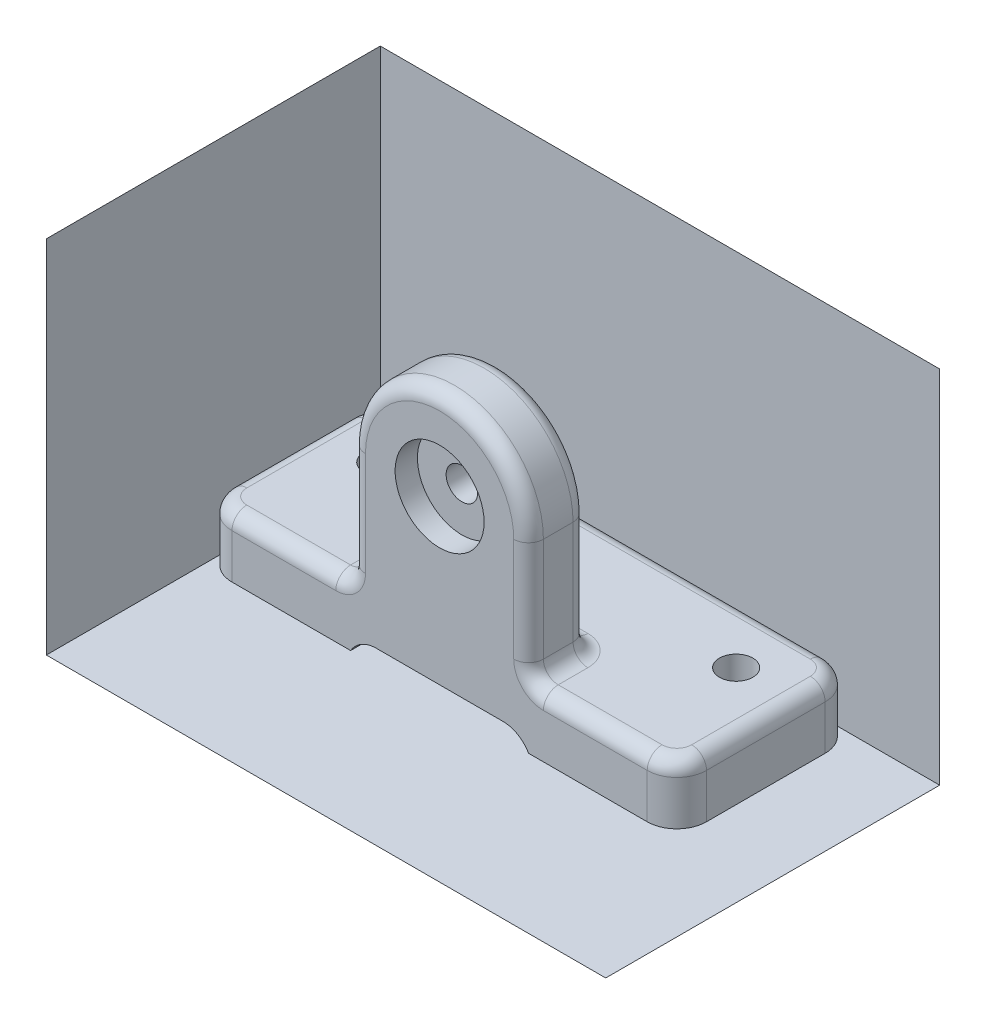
ISO-10303-21;
HEADER;
FILE_DESCRIPTION(('STEP AP214'),'2;1');
FILE_NAME('part.step','',(''),(''),'','','');
FILE_SCHEMA(('AUTOMOTIVE_DESIGN { 1 0 10303 214 1 1 1 1 }'));
ENDSEC;
DATA;
#1=APPLICATION_CONTEXT('core data for automotive mechanical design processes');
#2=APPLICATION_PROTOCOL_DEFINITION('international standard','automotive_design',2000,#1);
#3=PRODUCT_CONTEXT('',#1,'mechanical');
#4=PRODUCT('Part','Part','',(#3));
#5=PRODUCT_RELATED_PRODUCT_CATEGORY('part','',(#4));
#6=PRODUCT_DEFINITION_FORMATION('','',#4);
#7=PRODUCT_DEFINITION_CONTEXT('part definition',#1,'design');
#8=PRODUCT_DEFINITION('design','',#6,#7);
#9=PRODUCT_DEFINITION_SHAPE('','',#8);
#10=(LENGTH_UNIT() NAMED_UNIT(*) SI_UNIT(.MILLI.,.METRE.));
#11=(NAMED_UNIT(*) PLANE_ANGLE_UNIT() SI_UNIT($,.RADIAN.));
#12=(NAMED_UNIT(*) SI_UNIT($,.STERADIAN.) SOLID_ANGLE_UNIT());
#13=UNCERTAINTY_MEASURE_WITH_UNIT(LENGTH_MEASURE(1.E-05),#10,'distance_accuracy_value','');
#14=(GEOMETRIC_REPRESENTATION_CONTEXT(3) GLOBAL_UNCERTAINTY_ASSIGNED_CONTEXT((#13)) GLOBAL_UNIT_ASSIGNED_CONTEXT((#10,
#11,#12)) REPRESENTATION_CONTEXT('',''));
#15=CARTESIAN_POINT('',(0.,0.,0.));
#16=DIRECTION('',(0.,0.,1.));
#17=DIRECTION('',(1.,0.,0.));
#18=AXIS2_PLACEMENT_3D('',#15,#16,#17);
#19=CARTESIAN_POINT('',(0.,0.,33.4078891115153));
#20=DIRECTION('',(0.,1.,0.));
#21=DIRECTION('',(0.,0.,1.));
#22=AXIS2_PLACEMENT_3D('',#19,#20,#21);
#23=PLANE('',#22);
#24=DIRECTION('',(0.,0.,-1.));
#25=VECTOR('',#24,1.);
#26=CARTESIAN_POINT('',(0.,0.,-38.1));
#27=LINE('',#26,#25);
#28=CARTESIAN_POINT('',(0.,0.,33.4078891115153));
#29=VERTEX_POINT('',#28);
#30=CARTESIAN_POINT('',(0.,0.,-38.1));
#31=VERTEX_POINT('',#30);
#32=EDGE_CURVE('E50',#29,#31,#27,.T.);
#33=ORIENTED_EDGE('',*,*,#32,.T.);
#34=DIRECTION('',(1.,0.,0.));
#35=VECTOR('',#34,1.);
#36=CARTESIAN_POINT('',(0.,0.,-38.1));
#37=LINE('',#36,#35);
#38=CARTESIAN_POINT('',(119.774346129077,0.,-38.1));
#39=VERTEX_POINT('',#38);
#40=EDGE_CURVE('E61',#31,#39,#37,.T.);
#41=ORIENTED_EDGE('',*,*,#40,.T.);
#42=DIRECTION('',(0.,0.,1.));
#43=VECTOR('',#42,1.);
#44=CARTESIAN_POINT('',(119.774346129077,0.,-38.1));
#45=LINE('',#44,#43);
#46=CARTESIAN_POINT('',(119.774346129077,0.,33.4078891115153));
#47=VERTEX_POINT('',#46);
#48=EDGE_CURVE('E46',#39,#47,#45,.T.);
#49=ORIENTED_EDGE('',*,*,#48,.T.);
#50=DIRECTION('',(-1.,0.,0.));
#51=VECTOR('',#50,1.);
#52=CARTESIAN_POINT('',(0.,0.,33.4078891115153));
#53=LINE('',#52,#51);
#54=EDGE_CURVE('E12',#47,#29,#53,.T.);
#55=ORIENTED_EDGE('',*,*,#54,.T.);
#56=EDGE_LOOP('',(#33,#41,#49,#55));
#57=FACE_BOUND('',#56,.T.);
#58=ADVANCED_FACE('F41',(#57),#23,.F.);
#59=OPEN_SHELL('',(#58));
#60=SHELL_BASED_SURFACE_MODEL('B2',(#59));
#61=CARTESIAN_POINT('',(0.,77.180854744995,33.4078891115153));
#62=DIRECTION('',(1.,0.,0.));
#63=DIRECTION('',(0.,0.,-1.));
#64=AXIS2_PLACEMENT_3D('',#61,#62,#63);
#65=PLANE('',#64);
#66=DIRECTION('',(0.,1.,0.));
#67=VECTOR('',#66,1.);
#68=CARTESIAN_POINT('',(0.,77.180854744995,33.4078891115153));
#69=LINE('',#68,#67);
#70=CARTESIAN_POINT('',(0.,0.,33.4078891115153));
#71=VERTEX_POINT('',#70);
#72=CARTESIAN_POINT('',(0.,77.180854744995,33.4078891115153));
#73=VERTEX_POINT('',#72);
#74=EDGE_CURVE('E101',#71,#73,#69,.T.);
#75=ORIENTED_EDGE('',*,*,#74,.T.);
#76=DIRECTION('',(0.,0.,-1.));
#77=VECTOR('',#76,1.);
#78=CARTESIAN_POINT('',(0.,77.180854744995,33.4078891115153));
#79=LINE('',#78,#77);
#80=CARTESIAN_POINT('',(0.,77.180854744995,-38.1));
#81=VERTEX_POINT('',#80);
#82=EDGE_CURVE('E112',#73,#81,#79,.T.);
#83=ORIENTED_EDGE('',*,*,#82,.T.);
#84=DIRECTION('',(0.,-1.,0.));
#85=VECTOR('',#84,1.);
#86=CARTESIAN_POINT('',(0.,77.180854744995,-38.1));
#87=LINE('',#86,#85);
#88=CARTESIAN_POINT('',(0.,0.,-38.1));
#89=VERTEX_POINT('',#88);
#90=EDGE_CURVE('E97',#81,#89,#87,.T.);
#91=ORIENTED_EDGE('',*,*,#90,.T.);
#92=DIRECTION('',(0.,0.,1.));
#93=VECTOR('',#92,1.);
#94=CARTESIAN_POINT('',(0.,0.,33.4078891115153));
#95=LINE('',#94,#93);
#96=EDGE_CURVE('E39',#89,#71,#95,.T.);
#97=ORIENTED_EDGE('',*,*,#96,.T.);
#98=EDGE_LOOP('',(#75,#83,#91,#97));
#99=FACE_BOUND('',#98,.T.);
#100=ADVANCED_FACE('F92',(#99),#65,.F.);
#101=OPEN_SHELL('',(#100));
#102=SHELL_BASED_SURFACE_MODEL('B6',(#101));
#103=CARTESIAN_POINT('',(0.,0.,-38.1));
#104=DIRECTION('',(0.,0.,1.));
#105=DIRECTION('',(1.,0.,0.));
#106=AXIS2_PLACEMENT_3D('',#103,#104,#105);
#107=PLANE('',#106);
#108=DIRECTION('',(0.,1.,0.));
#109=VECTOR('',#108,1.);
#110=CARTESIAN_POINT('',(0.,77.180854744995,-38.1));
#111=LINE('',#110,#109);
#112=CARTESIAN_POINT('',(0.,0.,-38.1));
#113=VERTEX_POINT('',#112);
#114=CARTESIAN_POINT('',(0.,77.180854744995,-38.1));
#115=VERTEX_POINT('',#114);
#116=EDGE_CURVE('E151',#113,#115,#111,.T.);
#117=ORIENTED_EDGE('',*,*,#116,.T.);
#118=DIRECTION('',(1.,0.,0.));
#119=VECTOR('',#118,1.);
#120=CARTESIAN_POINT('',(0.,77.180854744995,-38.1));
#121=LINE('',#120,#119);
#122=CARTESIAN_POINT('',(119.774346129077,77.180854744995,-38.1));
#123=VERTEX_POINT('',#122);
#124=EDGE_CURVE('E162',#115,#123,#121,.T.);
#125=ORIENTED_EDGE('',*,*,#124,.T.);
#126=DIRECTION('',(0.,-1.,0.));
#127=VECTOR('',#126,1.);
#128=CARTESIAN_POINT('',(119.774346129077,77.180854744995,-38.1));
#129=LINE('',#128,#127);
#130=CARTESIAN_POINT('',(119.774346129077,0.,-38.1));
#131=VERTEX_POINT('',#130);
#132=EDGE_CURVE('E147',#123,#131,#129,.T.);
#133=ORIENTED_EDGE('',*,*,#132,.T.);
#134=DIRECTION('',(-1.,0.,0.));
#135=VECTOR('',#134,1.);
#136=CARTESIAN_POINT('',(0.,0.,-38.1));
#137=LINE('',#136,#135);
#138=EDGE_CURVE('E90',#131,#113,#137,.T.);
#139=ORIENTED_EDGE('',*,*,#138,.T.);
#140=EDGE_LOOP('',(#117,#125,#133,#139));
#141=FACE_BOUND('',#140,.T.);
#142=ADVANCED_FACE('F142',(#141),#107,.F.);
#143=OPEN_SHELL('',(#142));
#144=SHELL_BASED_SURFACE_MODEL('B33',(#143));
#145=CARTESIAN_POINT('',(0.,0.,-38.1));
#146=DIRECTION('',(0.,-1.,0.));
#147=DIRECTION('',(0.,0.,-1.));
#148=AXIS2_PLACEMENT_3D('',#145,#146,#147);
#149=PLANE('',#148);
#150=DIRECTION('',(0.,0.,-1.));
#151=VECTOR('',#150,1.);
#152=CARTESIAN_POINT('',(101.6,0.,0.));
#153=LINE('',#152,#151);
#154=CARTESIAN_POINT('',(101.6,0.,-6.35));
#155=VERTEX_POINT('',#154);
#156=CARTESIAN_POINT('',(101.6,0.,-31.75));
#157=VERTEX_POINT('',#156);
#158=EDGE_CURVE('E386',#155,#157,#153,.T.);
#159=ORIENTED_EDGE('',*,*,#158,.F.);
#160=CARTESIAN_POINT('',(95.25,0.,-6.35));
#161=DIRECTION('',(0.,-1.,0.));
#162=DIRECTION('',(0.,0.,-1.));
#163=AXIS2_PLACEMENT_3D('',#160,#161,#162);
#164=CIRCLE('',#163,6.35);
#165=CARTESIAN_POINT('',(95.25,0.,0.));
#166=VERTEX_POINT('',#165);
#167=EDGE_CURVE('E450',#155,#166,#164,.T.);
#168=ORIENTED_EDGE('',*,*,#167,.T.);
#169=DIRECTION('',(1.,0.,0.));
#170=VECTOR('',#169,1.);
#171=CARTESIAN_POINT('',(0.,0.,0.));
#172=LINE('',#171,#170);
#173=CARTESIAN_POINT('',(69.85,0.,-2.27373675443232E-10));
#174=VERTEX_POINT('',#173);
#175=EDGE_CURVE('E387',#174,#166,#172,.T.);
#176=ORIENTED_EDGE('',*,*,#175,.F.);
#177=DIRECTION('',(0.,0.,1.));
#178=VECTOR('',#177,1.);
#179=CARTESIAN_POINT('',(69.85,0.,-38.1));
#180=LINE('',#179,#178);
#181=CARTESIAN_POINT('',(69.85,0.,-38.1));
#182=VERTEX_POINT('',#181);
#183=EDGE_CURVE('E394',#182,#174,#180,.T.);
#184=ORIENTED_EDGE('',*,*,#183,.F.);
#185=DIRECTION('',(-1.,0.,0.));
#186=VECTOR('',#185,1.);
#187=CARTESIAN_POINT('',(0.,0.,-38.1));
#188=LINE('',#187,#186);
#189=CARTESIAN_POINT('',(95.25,0.,-38.1));
#190=VERTEX_POINT('',#189);
#191=EDGE_CURVE('E423',#190,#182,#188,.T.);
#192=ORIENTED_EDGE('',*,*,#191,.F.);
#193=CARTESIAN_POINT('',(95.25,0.,-31.75));
#194=DIRECTION('',(0.,-1.,0.));
#195=DIRECTION('',(0.,0.,-1.));
#196=AXIS2_PLACEMENT_3D('',#193,#194,#195);
#197=CIRCLE('',#196,6.35);
#198=EDGE_CURVE('E448',#190,#157,#197,.T.);
#199=ORIENTED_EDGE('',*,*,#198,.T.);
#200=EDGE_LOOP('',(#159,#168,#176,#184,#192,#199));
#201=FACE_BOUND('',#200,.T.);
#202=CARTESIAN_POINT('',(88.9,0.,-25.4));
#203=DIRECTION('',(0.,1.,0.));
#204=DIRECTION('',(0.,0.,1.));
#205=AXIS2_PLACEMENT_3D('',#202,#203,#204);
#206=CIRCLE('',#205,3.571875);
#207=CARTESIAN_POINT('',(88.9,0.,-21.828125));
#208=VERTEX_POINT('',#207);
#209=EDGE_CURVE('E668',#208,#208,#206,.T.);
#210=ORIENTED_EDGE('',*,*,#209,.T.);
#211=EDGE_LOOP('',(#210));
#212=FACE_BOUND('',#211,.T.);
#213=ADVANCED_FACE('F183',(#201,#212),#149,.T.);
#214=CARTESIAN_POINT('',(6.35,0.,0.));
#215=VERTEX_POINT('',#214);
#216=CARTESIAN_POINT('',(31.75,0.,-2.27373675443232E-10));
#217=VERTEX_POINT('',#216);
#218=EDGE_CURVE('E379',#215,#217,#172,.T.);
#219=ORIENTED_EDGE('',*,*,#218,.F.);
#220=CARTESIAN_POINT('',(6.35,0.,-6.35));
#221=DIRECTION('',(0.,-1.,0.));
#222=DIRECTION('',(0.,0.,-1.));
#223=AXIS2_PLACEMENT_3D('',#220,#221,#222);
#224=CIRCLE('',#223,6.35);
#225=CARTESIAN_POINT('',(0.,0.,-6.35));
#226=VERTEX_POINT('',#225);
#227=EDGE_CURVE('E436',#215,#226,#224,.T.);
#228=ORIENTED_EDGE('',*,*,#227,.T.);
#229=DIRECTION('',(0.,0.,1.));
#230=VECTOR('',#229,1.);
#231=CARTESIAN_POINT('',(0.,0.,0.));
#232=LINE('',#231,#230);
#233=CARTESIAN_POINT('',(0.,0.,-31.75));
#234=VERTEX_POINT('',#233);
#235=EDGE_CURVE('E416',#234,#226,#232,.T.);
#236=ORIENTED_EDGE('',*,*,#235,.F.);
#237=CARTESIAN_POINT('',(6.35,0.,-31.75));
#238=DIRECTION('',(0.,-1.,0.));
#239=DIRECTION('',(0.,0.,-1.));
#240=AXIS2_PLACEMENT_3D('',#237,#238,#239);
#241=CIRCLE('',#240,6.35);
#242=CARTESIAN_POINT('',(6.35,0.,-38.1));
#243=VERTEX_POINT('',#242);
#244=EDGE_CURVE('E434',#234,#243,#241,.T.);
#245=ORIENTED_EDGE('',*,*,#244,.T.);
#246=CARTESIAN_POINT('',(31.75,0.,-38.1));
#247=VERTEX_POINT('',#246);
#248=EDGE_CURVE('E393',#247,#243,#188,.T.);
#249=ORIENTED_EDGE('',*,*,#248,.F.);
#250=DIRECTION('',(0.,0.,1.));
#251=VECTOR('',#250,1.);
#252=CARTESIAN_POINT('',(31.75,0.,-38.1));
#253=LINE('',#252,#251);
#254=EDGE_CURVE('E370',#247,#217,#253,.T.);
#255=ORIENTED_EDGE('',*,*,#254,.T.);
#256=EDGE_LOOP('',(#219,#228,#236,#245,#249,#255));
#257=FACE_BOUND('',#256,.T.);
#258=CARTESIAN_POINT('',(12.7,0.,-25.4));
#259=DIRECTION('',(0.,1.,0.));
#260=DIRECTION('',(0.,0.,1.));
#261=AXIS2_PLACEMENT_3D('',#258,#259,#260);
#262=CIRCLE('',#261,3.571875);
#263=CARTESIAN_POINT('',(12.7,0.,-21.828125));
#264=VERTEX_POINT('',#263);
#265=EDGE_CURVE('E674',#264,#264,#262,.T.);
#266=ORIENTED_EDGE('',*,*,#265,.T.);
#267=EDGE_LOOP('',(#266));
#268=FACE_BOUND('',#267,.T.);
#269=ADVANCED_FACE('F390',(#257,#268),#149,.T.);
#270=CARTESIAN_POINT('',(0.,12.7,0.));
#271=DIRECTION('',(1.,0.,0.));
#272=DIRECTION('',(0.,0.,-1.));
#273=AXIS2_PLACEMENT_3D('',#270,#271,#272);
#274=PLANE('',#273);
#275=DIRECTION('',(0.,-1.,0.));
#276=VECTOR('',#275,1.);
#277=CARTESIAN_POINT('',(0.,12.7,-6.35));
#278=LINE('',#277,#276);
#279=CARTESIAN_POINT('',(0.,9.525,-6.35));
#280=VERTEX_POINT('',#279);
#281=EDGE_CURVE('E440',#226,#280,#278,.F.);
#282=ORIENTED_EDGE('',*,*,#281,.T.);
#283=DIRECTION('',(0.,0.,1.));
#284=VECTOR('',#283,1.);
#285=CARTESIAN_POINT('',(0.,9.525,0.));
#286=LINE('',#285,#284);
#287=CARTESIAN_POINT('',(0.,9.525,-31.75));
#288=VERTEX_POINT('',#287);
#289=EDGE_CURVE('E535',#280,#288,#286,.F.);
#290=ORIENTED_EDGE('',*,*,#289,.T.);
#291=DIRECTION('',(0.,-1.,0.));
#292=VECTOR('',#291,1.);
#293=CARTESIAN_POINT('',(0.,12.7,-31.75));
#294=LINE('',#293,#292);
#295=EDGE_CURVE('E438',#288,#234,#294,.T.);
#296=ORIENTED_EDGE('',*,*,#295,.T.);
#297=ORIENTED_EDGE('',*,*,#235,.T.);
#298=EDGE_LOOP('',(#282,#290,#296,#297));
#299=FACE_BOUND('',#298,.T.);
#300=ADVANCED_FACE('F185',(#299),#274,.F.);
#301=CARTESIAN_POINT('',(0.,12.7,0.));
#302=DIRECTION('',(0.,0.,-1.));
#303=DIRECTION('',(-1.,0.,0.));
#304=AXIS2_PLACEMENT_3D('',#301,#302,#303);
#305=PLANE('',#304);
#306=CARTESIAN_POINT('',(50.8,38.1,-1.13686837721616E-10));
#307=DIRECTION('',(0.,0.,1.));
#308=DIRECTION('',(1.,0.,0.));
#309=AXIS2_PLACEMENT_3D('',#306,#307,#308);
#310=CIRCLE('',#309,9.52499999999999);
#311=CARTESIAN_POINT('',(60.325,38.1,-1.13686837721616E-10));
#312=VERTEX_POINT('',#311);
#313=EDGE_CURVE('E409',#312,#312,#310,.T.);
#314=ORIENTED_EDGE('',*,*,#313,.F.);
#315=EDGE_LOOP('',(#314));
#316=FACE_BOUND('',#315,.T.);
#317=DIRECTION('',(0.,-1.,0.));
#318=VECTOR('',#317,1.);
#319=CARTESIAN_POINT('',(95.25,12.7,0.));
#320=LINE('',#319,#318);
#321=CARTESIAN_POINT('',(95.25,9.525,0.));
#322=VERTEX_POINT('',#321);
#323=EDGE_CURVE('E431',#166,#322,#320,.F.);
#324=ORIENTED_EDGE('',*,*,#323,.T.);
#325=DIRECTION('',(1.,0.,0.));
#326=VECTOR('',#325,1.);
#327=CARTESIAN_POINT('',(0.,9.525,0.));
#328=LINE('',#327,#326);
#329=CARTESIAN_POINT('',(73.025,9.525,0.));
#330=VERTEX_POINT('',#329);
#331=EDGE_CURVE('E533',#322,#330,#328,.F.);
#332=ORIENTED_EDGE('',*,*,#331,.T.);
#333=CARTESIAN_POINT('',(73.025,15.875,0.));
#334=DIRECTION('',(0.,0.,-1.));
#335=DIRECTION('',(-1.,0.,0.));
#336=AXIS2_PLACEMENT_3D('',#333,#334,#335);
#337=CIRCLE('',#336,6.35);
#338=CARTESIAN_POINT('',(66.675,15.875,0.));
#339=VERTEX_POINT('',#338);
#340=EDGE_CURVE('E530',#339,#330,#337,.F.);
#341=ORIENTED_EDGE('',*,*,#340,.F.);
#342=DIRECTION('',(0.,1.,0.));
#343=VECTOR('',#342,1.);
#344=CARTESIAN_POINT('',(66.675,38.1,0.));
#345=LINE('',#344,#343);
#346=CARTESIAN_POINT('',(66.675,38.1,0.));
#347=VERTEX_POINT('',#346);
#348=EDGE_CURVE('E528',#339,#347,#345,.T.);
#349=ORIENTED_EDGE('',*,*,#348,.T.);
#350=CARTESIAN_POINT('',(50.8,38.1,0.));
#351=DIRECTION('',(0.,0.,-1.));
#352=DIRECTION('',(-1.,0.,0.));
#353=AXIS2_PLACEMENT_3D('',#350,#351,#352);
#354=CIRCLE('',#353,15.875);
#355=CARTESIAN_POINT('',(34.925,38.1,0.));
#356=VERTEX_POINT('',#355);
#357=EDGE_CURVE('E526',#347,#356,#354,.F.);
#358=ORIENTED_EDGE('',*,*,#357,.T.);
#359=DIRECTION('',(0.,-1.,0.));
#360=VECTOR('',#359,1.);
#361=CARTESIAN_POINT('',(34.925,12.7,0.));
#362=LINE('',#361,#360);
#363=CARTESIAN_POINT('',(34.925,15.875,0.));
#364=VERTEX_POINT('',#363);
#365=EDGE_CURVE('E524',#356,#364,#362,.T.);
#366=ORIENTED_EDGE('',*,*,#365,.T.);
#367=CARTESIAN_POINT('',(28.575,15.875,0.));
#368=DIRECTION('',(0.,0.,-1.));
#369=DIRECTION('',(-1.,0.,0.));
#370=AXIS2_PLACEMENT_3D('',#367,#368,#369);
#371=CIRCLE('',#370,6.35);
#372=CARTESIAN_POINT('',(28.575,9.525,0.));
#373=VERTEX_POINT('',#372);
#374=EDGE_CURVE('E521',#373,#364,#371,.F.);
#375=ORIENTED_EDGE('',*,*,#374,.F.);
#376=DIRECTION('',(1.,0.,0.));
#377=VECTOR('',#376,1.);
#378=CARTESIAN_POINT('',(0.,9.525,0.));
#379=LINE('',#378,#377);
#380=CARTESIAN_POINT('',(6.35,9.525,0.));
#381=VERTEX_POINT('',#380);
#382=EDGE_CURVE('E519',#373,#381,#379,.F.);
#383=ORIENTED_EDGE('',*,*,#382,.T.);
#384=DIRECTION('',(0.,-1.,0.));
#385=VECTOR('',#384,1.);
#386=CARTESIAN_POINT('',(6.35,12.7,0.));
#387=LINE('',#386,#385);
#388=EDGE_CURVE('E383',#381,#215,#387,.T.);
#389=ORIENTED_EDGE('',*,*,#388,.T.);
#390=ORIENTED_EDGE('',*,*,#218,.T.);
#391=CARTESIAN_POINT('',(37.2492613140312,-3.17500000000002,0.));
#392=DIRECTION('',(0.,0.,-1.));
#393=DIRECTION('',(-1.,0.,0.));
#394=AXIS2_PLACEMENT_3D('',#391,#392,#393);
#395=CIRCLE('',#394,6.35);
#396=CARTESIAN_POINT('',(37.2492613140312,3.17499999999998,-2.27373675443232E-10));
#397=VERTEX_POINT('',#396);
#398=EDGE_CURVE('E365',#217,#397,#395,.T.);
#399=ORIENTED_EDGE('',*,*,#398,.T.);
#400=DIRECTION('',(-1.,0.,0.));
#401=VECTOR('',#400,1.);
#402=CARTESIAN_POINT('',(31.75,3.17499999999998,-2.27373675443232E-10));
#403=LINE('',#402,#401);
#404=CARTESIAN_POINT('',(64.3507386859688,3.17499999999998,-2.27373675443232E-10));
#405=VERTEX_POINT('',#404);
#406=EDGE_CURVE('E401',#405,#397,#403,.T.);
#407=ORIENTED_EDGE('',*,*,#406,.F.);
#408=CARTESIAN_POINT('',(64.3507386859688,-3.17500000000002,0.));
#409=DIRECTION('',(0.,0.,-1.));
#410=DIRECTION('',(-1.,0.,0.));
#411=AXIS2_PLACEMENT_3D('',#408,#409,#410);
#412=CIRCLE('',#411,6.35);
#413=EDGE_CURVE('E457',#405,#174,#412,.T.);
#414=ORIENTED_EDGE('',*,*,#413,.T.);
#415=ORIENTED_EDGE('',*,*,#175,.T.);
#416=EDGE_LOOP('',(#324,#332,#341,#349,#358,#366,#375,#383,#389,#390,#399,#407,#414,#415));
#417=FACE_BOUND('',#416,.T.);
#418=ADVANCED_FACE('F381',(#316,#417),#305,.F.);
#419=CARTESIAN_POINT('',(101.6,12.7,0.));
#420=DIRECTION('',(-1.,0.,0.));
#421=DIRECTION('',(0.,0.,1.));
#422=AXIS2_PLACEMENT_3D('',#419,#420,#421);
#423=PLANE('',#422);
#424=DIRECTION('',(0.,-1.,0.));
#425=VECTOR('',#424,1.);
#426=CARTESIAN_POINT('',(101.6,12.7,-31.75));
#427=LINE('',#426,#425);
#428=CARTESIAN_POINT('',(101.6,9.525,-31.75));
#429=VERTEX_POINT('',#428);
#430=EDGE_CURVE('E443',#157,#429,#427,.F.);
#431=ORIENTED_EDGE('',*,*,#430,.T.);
#432=DIRECTION('',(0.,0.,-1.));
#433=VECTOR('',#432,1.);
#434=CARTESIAN_POINT('',(101.6,9.525,0.));
#435=LINE('',#434,#433);
#436=CARTESIAN_POINT('',(101.6,9.525,-6.35));
#437=VERTEX_POINT('',#436);
#438=EDGE_CURVE('E504',#429,#437,#435,.F.);
#439=ORIENTED_EDGE('',*,*,#438,.T.);
#440=DIRECTION('',(0.,-1.,0.));
#441=VECTOR('',#440,1.);
#442=CARTESIAN_POINT('',(101.6,12.7,-6.35));
#443=LINE('',#442,#441);
#444=EDGE_CURVE('E446',#437,#155,#443,.T.);
#445=ORIENTED_EDGE('',*,*,#444,.T.);
#446=ORIENTED_EDGE('',*,*,#158,.T.);
#447=EDGE_LOOP('',(#431,#439,#445,#446));
#448=FACE_BOUND('',#447,.T.);
#449=ADVANCED_FACE('F696',(#448),#423,.F.);
#450=CARTESIAN_POINT('',(0.,12.7,-38.1));
#451=DIRECTION('',(0.,0.,1.));
#452=DIRECTION('',(1.,0.,0.));
#453=AXIS2_PLACEMENT_3D('',#450,#451,#452);
#454=PLANE('',#453);
#455=DIRECTION('',(0.,-1.,0.));
#456=VECTOR('',#455,1.);
#457=CARTESIAN_POINT('',(6.35,12.7,-38.1));
#458=LINE('',#457,#456);
#459=CARTESIAN_POINT('',(6.35,9.525,-38.1));
#460=VERTEX_POINT('',#459);
#461=EDGE_CURVE('E452',#243,#460,#458,.F.);
#462=ORIENTED_EDGE('',*,*,#461,.T.);
#463=DIRECTION('',(-1.,0.,0.));
#464=VECTOR('',#463,1.);
#465=CARTESIAN_POINT('',(0.,9.525,-38.1));
#466=LINE('',#465,#464);
#467=CARTESIAN_POINT('',(95.25,9.525,-38.1));
#468=VERTEX_POINT('',#467);
#469=EDGE_CURVE('E495',#460,#468,#466,.F.);
#470=ORIENTED_EDGE('',*,*,#469,.T.);
#471=DIRECTION('',(0.,-1.,0.));
#472=VECTOR('',#471,1.);
#473=CARTESIAN_POINT('',(95.25,12.7,-38.1));
#474=LINE('',#473,#472);
#475=EDGE_CURVE('E455',#468,#190,#474,.T.);
#476=ORIENTED_EDGE('',*,*,#475,.T.);
#477=ORIENTED_EDGE('',*,*,#191,.T.);
#478=CARTESIAN_POINT('',(64.3507386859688,-3.17500000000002,-38.1));
#479=DIRECTION('',(0.,0.,1.));
#480=DIRECTION('',(1.,0.,0.));
#481=AXIS2_PLACEMENT_3D('',#478,#479,#480);
#482=CIRCLE('',#481,6.35);
#483=CARTESIAN_POINT('',(64.3507386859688,3.17499999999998,-38.1));
#484=VERTEX_POINT('',#483);
#485=EDGE_CURVE('E376',#182,#484,#482,.T.);
#486=ORIENTED_EDGE('',*,*,#485,.T.);
#487=DIRECTION('',(-1.,0.,0.));
#488=VECTOR('',#487,1.);
#489=CARTESIAN_POINT('',(31.75,3.17499999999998,-38.1));
#490=LINE('',#489,#488);
#491=CARTESIAN_POINT('',(37.2492613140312,3.17499999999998,-38.1));
#492=VERTEX_POINT('',#491);
#493=EDGE_CURVE('E395',#484,#492,#490,.T.);
#494=ORIENTED_EDGE('',*,*,#493,.T.);
#495=CARTESIAN_POINT('',(37.2492613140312,-3.17500000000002,-38.1));
#496=DIRECTION('',(0.,0.,1.));
#497=DIRECTION('',(1.,0.,0.));
#498=AXIS2_PLACEMENT_3D('',#495,#496,#497);
#499=CIRCLE('',#498,6.35);
#500=EDGE_CURVE('E375',#492,#247,#499,.T.);
#501=ORIENTED_EDGE('',*,*,#500,.T.);
#502=ORIENTED_EDGE('',*,*,#248,.T.);
#503=EDGE_LOOP('',(#462,#470,#476,#477,#486,#494,#501,#502));
#504=FACE_BOUND('',#503,.T.);
#505=ADVANCED_FACE('F583',(#504),#454,.F.);
#506=CARTESIAN_POINT('',(0.,12.7,-38.1));
#507=DIRECTION('',(0.,-1.,0.));
#508=DIRECTION('',(0.,0.,-1.));
#509=AXIS2_PLACEMENT_3D('',#506,#507,#508);
#510=PLANE('',#509);
#511=CARTESIAN_POINT('',(66.675,12.7,-9.525));
#512=DIRECTION('',(0.,-1.,0.));
#513=DIRECTION('',(0.,0.,-1.));
#514=AXIS2_PLACEMENT_3D('',#511,#512,#513);
#515=CIRCLE('',#514,6.35);
#516=CARTESIAN_POINT('',(73.025,12.7,-9.525));
#517=VERTEX_POINT('',#516);
#518=CARTESIAN_POINT('',(66.675,12.7,-15.875));
#519=VERTEX_POINT('',#518);
#520=EDGE_CURVE('E487',#517,#519,#515,.F.);
#521=ORIENTED_EDGE('',*,*,#520,.F.);
#522=DIRECTION('',(0.,0.,1.));
#523=VECTOR('',#522,1.);
#524=CARTESIAN_POINT('',(73.025,12.7,-38.1));
#525=LINE('',#524,#523);
#526=CARTESIAN_POINT('',(73.025,12.7,-3.175));
#527=VERTEX_POINT('',#526);
#528=EDGE_CURVE('E490',#517,#527,#525,.T.);
#529=ORIENTED_EDGE('',*,*,#528,.T.);
#530=DIRECTION('',(1.,0.,0.));
#531=VECTOR('',#530,1.);
#532=CARTESIAN_POINT('',(0.,12.7,-3.175));
#533=LINE('',#532,#531);
#534=CARTESIAN_POINT('',(95.25,12.7,-3.175));
#535=VERTEX_POINT('',#534);
#536=EDGE_CURVE('E485',#527,#535,#533,.T.);
#537=ORIENTED_EDGE('',*,*,#536,.T.);
#538=CARTESIAN_POINT('',(95.25,12.7,-6.35));
#539=DIRECTION('',(0.,-1.,0.));
#540=DIRECTION('',(0.,0.,-1.));
#541=AXIS2_PLACEMENT_3D('',#538,#539,#540);
#542=CIRCLE('',#541,3.175);
#543=CARTESIAN_POINT('',(98.425,12.7,-6.35));
#544=VERTEX_POINT('',#543);
#545=EDGE_CURVE('E483',#535,#544,#542,.F.);
#546=ORIENTED_EDGE('',*,*,#545,.T.);
#547=DIRECTION('',(0.,0.,-1.));
#548=VECTOR('',#547,1.);
#549=CARTESIAN_POINT('',(98.425,12.7,-38.1));
#550=LINE('',#549,#548);
#551=CARTESIAN_POINT('',(98.425,12.7,-31.75));
#552=VERTEX_POINT('',#551);
#553=EDGE_CURVE('E476',#544,#552,#550,.T.);
#554=ORIENTED_EDGE('',*,*,#553,.T.);
#555=CARTESIAN_POINT('',(95.25,12.7,-31.75));
#556=DIRECTION('',(0.,-1.,0.));
#557=DIRECTION('',(0.,0.,-1.));
#558=AXIS2_PLACEMENT_3D('',#555,#556,#557);
#559=CIRCLE('',#558,3.175);
#560=CARTESIAN_POINT('',(95.25,12.7,-34.925));
#561=VERTEX_POINT('',#560);
#562=EDGE_CURVE('E473',#552,#561,#559,.F.);
#563=ORIENTED_EDGE('',*,*,#562,.T.);
#564=DIRECTION('',(-1.,0.,0.));
#565=VECTOR('',#564,1.);
#566=CARTESIAN_POINT('',(0.,12.7,-34.925));
#567=LINE('',#566,#565);
#568=CARTESIAN_POINT('',(6.35,12.7,-34.925));
#569=VERTEX_POINT('',#568);
#570=EDGE_CURVE('E471',#561,#569,#567,.T.);
#571=ORIENTED_EDGE('',*,*,#570,.T.);
#572=CARTESIAN_POINT('',(6.35,12.7,-31.75));
#573=DIRECTION('',(0.,-1.,0.));
#574=DIRECTION('',(0.,0.,-1.));
#575=AXIS2_PLACEMENT_3D('',#572,#573,#574);
#576=CIRCLE('',#575,3.175);
#577=CARTESIAN_POINT('',(3.175,12.7,-31.75));
#578=VERTEX_POINT('',#577);
#579=EDGE_CURVE('E467',#569,#578,#576,.F.);
#580=ORIENTED_EDGE('',*,*,#579,.T.);
#581=DIRECTION('',(0.,0.,1.));
#582=VECTOR('',#581,1.);
#583=CARTESIAN_POINT('',(3.175,12.7,-38.1));
#584=LINE('',#583,#582);
#585=CARTESIAN_POINT('',(3.175,12.7,-6.35));
#586=VERTEX_POINT('',#585);
#587=EDGE_CURVE('E465',#578,#586,#584,.T.);
#588=ORIENTED_EDGE('',*,*,#587,.T.);
#589=CARTESIAN_POINT('',(6.35,12.7,-6.35));
#590=DIRECTION('',(0.,-1.,0.));
#591=DIRECTION('',(0.,0.,-1.));
#592=AXIS2_PLACEMENT_3D('',#589,#590,#591);
#593=CIRCLE('',#592,3.175);
#594=CARTESIAN_POINT('',(6.35,12.7,-3.175));
#595=VERTEX_POINT('',#594);
#596=EDGE_CURVE('E463',#586,#595,#593,.F.);
#597=ORIENTED_EDGE('',*,*,#596,.T.);
#598=DIRECTION('',(1.,0.,0.));
#599=VECTOR('',#598,1.);
#600=CARTESIAN_POINT('',(0.,12.7,-3.175));
#601=LINE('',#600,#599);
#602=CARTESIAN_POINT('',(28.575,12.7,-3.175));
#603=VERTEX_POINT('',#602);
#604=EDGE_CURVE('E461',#595,#603,#601,.T.);
#605=ORIENTED_EDGE('',*,*,#604,.T.);
#606=DIRECTION('',(0.,0.,-1.));
#607=VECTOR('',#606,1.);
#608=CARTESIAN_POINT('',(28.575,12.7,-38.1));
#609=LINE('',#608,#607);
#610=CARTESIAN_POINT('',(28.575,12.7,-9.525));
#611=VERTEX_POINT('',#610);
#612=EDGE_CURVE('E469',#603,#611,#609,.T.);
#613=ORIENTED_EDGE('',*,*,#612,.T.);
#614=CARTESIAN_POINT('',(34.925,12.7,-9.525));
#615=DIRECTION('',(0.,-1.,0.));
#616=DIRECTION('',(0.,0.,-1.));
#617=AXIS2_PLACEMENT_3D('',#614,#615,#616);
#618=CIRCLE('',#617,6.35);
#619=CARTESIAN_POINT('',(34.925,12.7,-15.875));
#620=VERTEX_POINT('',#619);
#621=EDGE_CURVE('E478',#620,#611,#618,.F.);
#622=ORIENTED_EDGE('',*,*,#621,.F.);
#623=DIRECTION('',(1.,0.,0.));
#624=VECTOR('',#623,1.);
#625=CARTESIAN_POINT('',(0.,12.7,-15.875));
#626=LINE('',#625,#624);
#627=EDGE_CURVE('E481',#620,#519,#626,.T.);
#628=ORIENTED_EDGE('',*,*,#627,.T.);
#629=EDGE_LOOP('',(#521,#529,#537,#546,#554,#563,#571,#580,#588,#597,#605,#613,#622,#628));
#630=FACE_BOUND('',#629,.T.);
#631=CARTESIAN_POINT('',(88.9,12.6999999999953,-25.4));
#632=DIRECTION('',(0.,1.,0.));
#633=DIRECTION('',(0.,0.,1.));
#634=AXIS2_PLACEMENT_3D('',#631,#632,#633);
#635=CIRCLE('',#634,3.57187499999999);
#636=CARTESIAN_POINT('',(88.9,12.6999999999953,-21.828125));
#637=VERTEX_POINT('',#636);
#638=EDGE_CURVE('E671',#637,#637,#635,.T.);
#639=ORIENTED_EDGE('',*,*,#638,.F.);
#640=EDGE_LOOP('',(#639));
#641=FACE_BOUND('',#640,.T.);
#642=CARTESIAN_POINT('',(12.7,12.6999999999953,-25.4));
#643=DIRECTION('',(0.,1.,0.));
#644=DIRECTION('',(0.,0.,1.));
#645=AXIS2_PLACEMENT_3D('',#642,#643,#644);
#646=CIRCLE('',#645,3.57187499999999);
#647=CARTESIAN_POINT('',(12.7,12.6999999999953,-21.828125));
#648=VERTEX_POINT('',#647);
#649=EDGE_CURVE('E677',#648,#648,#646,.T.);
#650=ORIENTED_EDGE('',*,*,#649,.F.);
#651=EDGE_LOOP('',(#650));
#652=FACE_BOUND('',#651,.T.);
#653=ADVANCED_FACE('F684',(#630,#641,#652),#510,.F.);
#654=CARTESIAN_POINT('',(31.75,0.,-12.7));
#655=DIRECTION('',(-1.,0.,0.));
#656=DIRECTION('',(0.,0.,1.));
#657=AXIS2_PLACEMENT_3D('',#654,#655,#656);
#658=PLANE('',#657);
#659=DIRECTION('',(0.,0.,1.));
#660=VECTOR('',#659,1.);
#661=CARTESIAN_POINT('',(31.75,38.1,-12.7));
#662=LINE('',#661,#660);
#663=CARTESIAN_POINT('',(31.75,38.1,-9.525));
#664=VERTEX_POINT('',#663);
#665=CARTESIAN_POINT('',(31.75,38.1,-3.175));
#666=VERTEX_POINT('',#665);
#667=EDGE_CURVE('E413',#664,#666,#662,.T.);
#668=ORIENTED_EDGE('',*,*,#667,.F.);
#669=DIRECTION('',(0.,-1.,0.));
#670=VECTOR('',#669,1.);
#671=CARTESIAN_POINT('',(31.75,0.,-9.525));
#672=LINE('',#671,#670);
#673=CARTESIAN_POINT('',(31.75,15.875,-9.525));
#674=VERTEX_POINT('',#673);
#675=EDGE_CURVE('E502',#664,#674,#672,.T.);
#676=ORIENTED_EDGE('',*,*,#675,.T.);
#677=DIRECTION('',(0.,0.,-1.));
#678=VECTOR('',#677,1.);
#679=CARTESIAN_POINT('',(31.75,15.875,-12.7));
#680=LINE('',#679,#678);
#681=CARTESIAN_POINT('',(31.75,15.875,-3.175));
#682=VERTEX_POINT('',#681);
#683=EDGE_CURVE('E499',#674,#682,#680,.F.);
#684=ORIENTED_EDGE('',*,*,#683,.T.);
#685=DIRECTION('',(0.,-1.,0.));
#686=VECTOR('',#685,1.);
#687=CARTESIAN_POINT('',(31.75,38.1,-3.175));
#688=LINE('',#687,#686);
#689=EDGE_CURVE('E497',#682,#666,#688,.F.);
#690=ORIENTED_EDGE('',*,*,#689,.T.);
#691=EDGE_LOOP('',(#668,#676,#684,#690));
#692=FACE_BOUND('',#691,.T.);
#693=ADVANCED_FACE('F686',(#692),#658,.T.);
#694=CARTESIAN_POINT('',(69.85,38.1,-12.7));
#695=DIRECTION('',(1.,0.,0.));
#696=DIRECTION('',(0.,0.,-1.));
#697=AXIS2_PLACEMENT_3D('',#694,#695,#696);
#698=PLANE('',#697);
#699=DIRECTION('',(0.,0.,1.));
#700=VECTOR('',#699,1.);
#701=CARTESIAN_POINT('',(69.85,15.875,-12.7));
#702=LINE('',#701,#700);
#703=CARTESIAN_POINT('',(69.85,15.875,-3.175));
#704=VERTEX_POINT('',#703);
#705=CARTESIAN_POINT('',(69.85,15.875,-9.525));
#706=VERTEX_POINT('',#705);
#707=EDGE_CURVE('E191',#704,#706,#702,.F.);
#708=ORIENTED_EDGE('',*,*,#707,.T.);
#709=DIRECTION('',(0.,1.,0.));
#710=VECTOR('',#709,1.);
#711=CARTESIAN_POINT('',(69.85,38.1,-9.525));
#712=LINE('',#711,#710);
#713=CARTESIAN_POINT('',(69.85,38.1,-9.525));
#714=VERTEX_POINT('',#713);
#715=EDGE_CURVE('E140',#706,#714,#712,.T.);
#716=ORIENTED_EDGE('',*,*,#715,.T.);
#717=DIRECTION('',(0.,0.,1.));
#718=VECTOR('',#717,1.);
#719=CARTESIAN_POINT('',(69.85,38.1,-12.7));
#720=LINE('',#719,#718);
#721=CARTESIAN_POINT('',(69.85,38.1,-3.175));
#722=VERTEX_POINT('',#721);
#723=EDGE_CURVE('E417',#714,#722,#720,.T.);
#724=ORIENTED_EDGE('',*,*,#723,.T.);
#725=DIRECTION('',(0.,1.,0.));
#726=VECTOR('',#725,1.);
#727=CARTESIAN_POINT('',(69.85,12.7,-3.175));
#728=LINE('',#727,#726);
#729=EDGE_CURVE('E201',#722,#704,#728,.F.);
#730=ORIENTED_EDGE('',*,*,#729,.T.);
#731=EDGE_LOOP('',(#708,#716,#724,#730));
#732=FACE_BOUND('',#731,.T.);
#733=ADVANCED_FACE('F693',(#732),#698,.T.);
#734=CARTESIAN_POINT('',(50.8,38.1,-12.7));
#735=DIRECTION('',(0.,0.,-1.));
#736=DIRECTION('',(-1.,0.,0.));
#737=AXIS2_PLACEMENT_3D('',#734,#735,#736);
#738=PLANE('',#737);
#739=DIRECTION('',(1.,0.,0.));
#740=VECTOR('',#739,1.);
#741=CARTESIAN_POINT('',(50.8,15.875,-12.7));
#742=LINE('',#741,#740);
#743=CARTESIAN_POINT('',(66.675,15.875,-12.7));
#744=VERTEX_POINT('',#743);
#745=CARTESIAN_POINT('',(34.925,15.875,-12.7));
#746=VERTEX_POINT('',#745);
#747=EDGE_CURVE('E512',#744,#746,#742,.F.);
#748=ORIENTED_EDGE('',*,*,#747,.T.);
#749=DIRECTION('',(0.,-1.,0.));
#750=VECTOR('',#749,1.);
#751=CARTESIAN_POINT('',(34.925,38.1,-12.7));
#752=LINE('',#751,#750);
#753=CARTESIAN_POINT('',(34.925,38.1,-12.7));
#754=VERTEX_POINT('',#753);
#755=EDGE_CURVE('E514',#746,#754,#752,.F.);
#756=ORIENTED_EDGE('',*,*,#755,.T.);
#757=CARTESIAN_POINT('',(50.8,38.1,-12.7));
#758=DIRECTION('',(0.,0.,-1.));
#759=DIRECTION('',(-1.,0.,0.));
#760=AXIS2_PLACEMENT_3D('',#757,#758,#759);
#761=CIRCLE('',#760,15.875);
#762=CARTESIAN_POINT('',(66.675,38.1,-12.7));
#763=VERTEX_POINT('',#762);
#764=EDGE_CURVE('E510',#754,#763,#761,.T.);
#765=ORIENTED_EDGE('',*,*,#764,.T.);
#766=DIRECTION('',(0.,1.,0.));
#767=VECTOR('',#766,1.);
#768=CARTESIAN_POINT('',(66.675,38.1,-12.7));
#769=LINE('',#768,#767);
#770=EDGE_CURVE('E508',#763,#744,#769,.F.);
#771=ORIENTED_EDGE('',*,*,#770,.T.);
#772=EDGE_LOOP('',(#748,#756,#765,#771));
#773=FACE_BOUND('',#772,.T.);
#774=CARTESIAN_POINT('',(50.8,38.1,-12.7));
#775=DIRECTION('',(0.,0.,-1.));
#776=DIRECTION('',(-1.,0.,0.));
#777=AXIS2_PLACEMENT_3D('',#774,#775,#776);
#778=CIRCLE('',#777,3.37819999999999);
#779=CARTESIAN_POINT('',(47.4218,38.1,-12.7));
#780=VERTEX_POINT('',#779);
#781=EDGE_CURVE('E412',#780,#780,#778,.T.);
#782=ORIENTED_EDGE('',*,*,#781,.F.);
#783=EDGE_LOOP('',(#782));
#784=FACE_BOUND('',#783,.T.);
#785=ADVANCED_FACE('F708',(#773,#784),#738,.T.);
#786=CARTESIAN_POINT('',(50.8,38.1,-12.7));
#787=DIRECTION('',(0.,0.,1.));
#788=DIRECTION('',(1.,0.,0.));
#789=AXIS2_PLACEMENT_3D('',#786,#787,#788);
#790=CYLINDRICAL_SURFACE('',#789,19.05);
#791=ORIENTED_EDGE('',*,*,#723,.F.);
#792=CARTESIAN_POINT('',(50.8,38.1,-9.525));
#793=DIRECTION('',(0.,0.,-1.));
#794=DIRECTION('',(-1.,0.,0.));
#795=AXIS2_PLACEMENT_3D('',#792,#793,#794);
#796=CIRCLE('',#795,19.05);
#797=EDGE_CURVE('E539',#714,#664,#796,.F.);
#798=ORIENTED_EDGE('',*,*,#797,.T.);
#799=ORIENTED_EDGE('',*,*,#667,.T.);
#800=CARTESIAN_POINT('',(50.8,38.1,-3.175));
#801=DIRECTION('',(0.,0.,-1.));
#802=DIRECTION('',(-1.,0.,0.));
#803=AXIS2_PLACEMENT_3D('',#800,#801,#802);
#804=CIRCLE('',#803,19.05);
#805=EDGE_CURVE('E537',#666,#722,#804,.T.);
#806=ORIENTED_EDGE('',*,*,#805,.T.);
#807=EDGE_LOOP('',(#791,#798,#799,#806));
#808=FACE_BOUND('',#807,.T.);
#809=ADVANCED_FACE('F709',(#808),#790,.T.);
#810=CARTESIAN_POINT('',(50.8,38.1,-1.13686837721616E-10));
#811=DIRECTION('',(0.,0.,1.));
#812=DIRECTION('',(1.,0.,0.));
#813=AXIS2_PLACEMENT_3D('',#810,#811,#812);
#814=CYLINDRICAL_SURFACE('',#813,9.52499999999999);
#815=CARTESIAN_POINT('',(50.8,38.1,-4.77520000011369));
#816=DIRECTION('',(0.,0.,1.));
#817=DIRECTION('',(1.,0.,0.));
#818=AXIS2_PLACEMENT_3D('',#815,#816,#817);
#819=CIRCLE('',#818,9.52499999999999);
#820=CARTESIAN_POINT('',(60.325,38.1,-4.77520000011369));
#821=VERTEX_POINT('',#820);
#822=EDGE_CURVE('E406',#821,#821,#819,.T.);
#823=ORIENTED_EDGE('',*,*,#822,.F.);
#824=EDGE_LOOP('',(#823));
#825=FACE_BOUND('',#824,.T.);
#826=ORIENTED_EDGE('',*,*,#313,.T.);
#827=EDGE_LOOP('',(#826));
#828=FACE_BOUND('',#827,.T.);
#829=ADVANCED_FACE('F711',(#825,#828),#814,.F.);
#830=CARTESIAN_POINT('',(54.1782,38.1,-4.77520000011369));
#831=DIRECTION('',(0.,0.,-1.));
#832=DIRECTION('',(-1.,0.,0.));
#833=AXIS2_PLACEMENT_3D('',#830,#831,#832);
#834=PLANE('',#833);
#835=CARTESIAN_POINT('',(50.8,38.1,-4.77520000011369));
#836=DIRECTION('',(0.,0.,1.));
#837=DIRECTION('',(1.,0.,0.));
#838=AXIS2_PLACEMENT_3D('',#835,#836,#837);
#839=CIRCLE('',#838,3.3782);
#840=CARTESIAN_POINT('',(54.1782,38.1,-4.77520000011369));
#841=VERTEX_POINT('',#840);
#842=EDGE_CURVE('E398',#841,#841,#839,.T.);
#843=ORIENTED_EDGE('',*,*,#842,.F.);
#844=EDGE_LOOP('',(#843));
#845=FACE_BOUND('',#844,.T.);
#846=ORIENTED_EDGE('',*,*,#822,.T.);
#847=EDGE_LOOP('',(#846));
#848=FACE_BOUND('',#847,.T.);
#849=ADVANCED_FACE('F719',(#845,#848),#834,.F.);
#850=CARTESIAN_POINT('',(50.8,38.1,-1.13686837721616E-10));
#851=DIRECTION('',(0.,0.,1.));
#852=DIRECTION('',(1.,0.,0.));
#853=AXIS2_PLACEMENT_3D('',#850,#851,#852);
#854=CYLINDRICAL_SURFACE('',#853,3.37819999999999);
#855=ORIENTED_EDGE('',*,*,#781,.T.);
#856=EDGE_LOOP('',(#855));
#857=FACE_BOUND('',#856,.T.);
#858=ORIENTED_EDGE('',*,*,#842,.T.);
#859=EDGE_LOOP('',(#858));
#860=FACE_BOUND('',#859,.T.);
#861=ADVANCED_FACE('F723',(#857,#860),#854,.F.);
#862=CARTESIAN_POINT('',(31.75,3.17499999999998,-38.1));
#863=DIRECTION('',(0.,1.,0.));
#864=DIRECTION('',(0.,0.,1.));
#865=AXIS2_PLACEMENT_3D('',#862,#863,#864);
#866=PLANE('',#865);
#867=ORIENTED_EDGE('',*,*,#493,.F.);
#868=DIRECTION('',(0.,0.,-1.));
#869=VECTOR('',#868,1.);
#870=CARTESIAN_POINT('',(64.3507386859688,3.17499999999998,-38.1));
#871=LINE('',#870,#869);
#872=EDGE_CURVE('E428',#484,#405,#871,.F.);
#873=ORIENTED_EDGE('',*,*,#872,.T.);
#874=ORIENTED_EDGE('',*,*,#406,.T.);
#875=DIRECTION('',(0.,0.,1.));
#876=VECTOR('',#875,1.);
#877=CARTESIAN_POINT('',(37.2492613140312,3.17499999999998,-38.1));
#878=LINE('',#877,#876);
#879=EDGE_CURVE('E371',#397,#492,#878,.F.);
#880=ORIENTED_EDGE('',*,*,#879,.T.);
#881=EDGE_LOOP('',(#867,#873,#874,#880));
#882=FACE_BOUND('',#881,.T.);
#883=ADVANCED_FACE('F589',(#882),#866,.F.);
#884=CARTESIAN_POINT('',(12.7,12.6999999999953,-25.4));
#885=DIRECTION('',(0.,1.,0.));
#886=DIRECTION('',(0.,0.,1.));
#887=AXIS2_PLACEMENT_3D('',#884,#885,#886);
#888=CYLINDRICAL_SURFACE('',#887,3.57187499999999);
#889=ORIENTED_EDGE('',*,*,#265,.F.);
#890=EDGE_LOOP('',(#889));
#891=FACE_BOUND('',#890,.T.);
#892=ORIENTED_EDGE('',*,*,#649,.T.);
#893=EDGE_LOOP('',(#892));
#894=FACE_BOUND('',#893,.T.);
#895=ADVANCED_FACE('F682',(#891,#894),#888,.F.);
#896=CARTESIAN_POINT('',(88.9,12.6999999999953,-25.4));
#897=DIRECTION('',(0.,1.,0.));
#898=DIRECTION('',(0.,0.,1.));
#899=AXIS2_PLACEMENT_3D('',#896,#897,#898);
#900=CYLINDRICAL_SURFACE('',#899,3.571875);
#901=ORIENTED_EDGE('',*,*,#209,.F.);
#902=EDGE_LOOP('',(#901));
#903=FACE_BOUND('',#902,.T.);
#904=ORIENTED_EDGE('',*,*,#638,.T.);
#905=EDGE_LOOP('',(#904));
#906=FACE_BOUND('',#905,.T.);
#907=ADVANCED_FACE('F732',(#903,#906),#900,.F.);
#908=CARTESIAN_POINT('',(64.3507386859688,-3.17500000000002,-38.1));
#909=DIRECTION('',(0.,0.,-1.));
#910=DIRECTION('',(-1.,0.,0.));
#911=AXIS2_PLACEMENT_3D('',#908,#909,#910);
#912=CYLINDRICAL_SURFACE('',#911,6.35);
#913=ORIENTED_EDGE('',*,*,#485,.F.);
#914=ORIENTED_EDGE('',*,*,#183,.T.);
#915=ORIENTED_EDGE('',*,*,#413,.F.);
#916=ORIENTED_EDGE('',*,*,#872,.F.);
#917=EDGE_LOOP('',(#913,#914,#915,#916));
#918=FACE_BOUND('',#917,.T.);
#919=ADVANCED_FACE('F591',(#918),#912,.F.);
#920=CARTESIAN_POINT('',(37.2492613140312,-3.17500000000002,-38.1));
#921=DIRECTION('',(0.,0.,1.));
#922=DIRECTION('',(1.,0.,0.));
#923=AXIS2_PLACEMENT_3D('',#920,#921,#922);
#924=CYLINDRICAL_SURFACE('',#923,6.35);
#925=ORIENTED_EDGE('',*,*,#500,.F.);
#926=ORIENTED_EDGE('',*,*,#879,.F.);
#927=ORIENTED_EDGE('',*,*,#398,.F.);
#928=ORIENTED_EDGE('',*,*,#254,.F.);
#929=EDGE_LOOP('',(#925,#926,#927,#928));
#930=FACE_BOUND('',#929,.T.);
#931=ADVANCED_FACE('F368',(#930),#924,.F.);
#932=CARTESIAN_POINT('',(6.35,12.7,-6.35));
#933=DIRECTION('',(0.,-1.,0.));
#934=DIRECTION('',(0.,0.,-1.));
#935=AXIS2_PLACEMENT_3D('',#932,#933,#934);
#936=CYLINDRICAL_SURFACE('',#935,6.35);
#937=ORIENTED_EDGE('',*,*,#388,.F.);
#938=CARTESIAN_POINT('',(6.35,9.525,-6.35));
#939=DIRECTION('',(0.,-1.,0.));
#940=DIRECTION('',(0.,0.,-1.));
#941=AXIS2_PLACEMENT_3D('',#938,#939,#940);
#942=CIRCLE('',#941,6.35);
#943=EDGE_CURVE('E541',#381,#280,#942,.T.);
#944=ORIENTED_EDGE('',*,*,#943,.T.);
#945=ORIENTED_EDGE('',*,*,#281,.F.);
#946=ORIENTED_EDGE('',*,*,#227,.F.);
#947=EDGE_LOOP('',(#937,#944,#945,#946));
#948=FACE_BOUND('',#947,.T.);
#949=ADVANCED_FACE('F546',(#948),#936,.T.);
#950=CARTESIAN_POINT('',(95.25,12.7,-6.35));
#951=DIRECTION('',(0.,-1.,0.));
#952=DIRECTION('',(0.,0.,-1.));
#953=AXIS2_PLACEMENT_3D('',#950,#951,#952);
#954=CYLINDRICAL_SURFACE('',#953,6.35);
#955=ORIENTED_EDGE('',*,*,#444,.F.);
#956=CARTESIAN_POINT('',(95.25,9.525,-6.35));
#957=DIRECTION('',(0.,-1.,0.));
#958=DIRECTION('',(0.,0.,-1.));
#959=AXIS2_PLACEMENT_3D('',#956,#957,#958);
#960=CIRCLE('',#959,6.35);
#961=EDGE_CURVE('E517',#437,#322,#960,.T.);
#962=ORIENTED_EDGE('',*,*,#961,.T.);
#963=ORIENTED_EDGE('',*,*,#323,.F.);
#964=ORIENTED_EDGE('',*,*,#167,.F.);
#965=EDGE_LOOP('',(#955,#962,#963,#964));
#966=FACE_BOUND('',#965,.T.);
#967=ADVANCED_FACE('F603',(#966),#954,.T.);
#968=CARTESIAN_POINT('',(95.25,12.7,-31.75));
#969=DIRECTION('',(0.,-1.,0.));
#970=DIRECTION('',(0.,0.,-1.));
#971=AXIS2_PLACEMENT_3D('',#968,#969,#970);
#972=CYLINDRICAL_SURFACE('',#971,6.35);
#973=ORIENTED_EDGE('',*,*,#475,.F.);
#974=CARTESIAN_POINT('',(95.25,9.525,-31.75));
#975=DIRECTION('',(0.,-1.,0.));
#976=DIRECTION('',(0.,0.,-1.));
#977=AXIS2_PLACEMENT_3D('',#974,#975,#976);
#978=CIRCLE('',#977,6.35);
#979=EDGE_CURVE('E492',#468,#429,#978,.T.);
#980=ORIENTED_EDGE('',*,*,#979,.T.);
#981=ORIENTED_EDGE('',*,*,#430,.F.);
#982=ORIENTED_EDGE('',*,*,#198,.F.);
#983=EDGE_LOOP('',(#973,#980,#981,#982));
#984=FACE_BOUND('',#983,.T.);
#985=ADVANCED_FACE('F744',(#984),#972,.T.);
#986=CARTESIAN_POINT('',(6.35,12.7,-31.75));
#987=DIRECTION('',(0.,-1.,0.));
#988=DIRECTION('',(0.,0.,-1.));
#989=AXIS2_PLACEMENT_3D('',#986,#987,#988);
#990=CYLINDRICAL_SURFACE('',#989,6.35);
#991=ORIENTED_EDGE('',*,*,#295,.F.);
#992=CARTESIAN_POINT('',(6.35,9.525,-31.75));
#993=DIRECTION('',(0.,-1.,0.));
#994=DIRECTION('',(0.,0.,-1.));
#995=AXIS2_PLACEMENT_3D('',#992,#993,#994);
#996=CIRCLE('',#995,6.35);
#997=EDGE_CURVE('E506',#288,#460,#996,.T.);
#998=ORIENTED_EDGE('',*,*,#997,.T.);
#999=ORIENTED_EDGE('',*,*,#461,.F.);
#1000=ORIENTED_EDGE('',*,*,#244,.F.);
#1001=EDGE_LOOP('',(#991,#998,#999,#1000));
#1002=FACE_BOUND('',#1001,.T.);
#1003=ADVANCED_FACE('F580',(#1002),#990,.T.);
#1004=CARTESIAN_POINT('',(34.925,0.,-9.525));
#1005=DIRECTION('',(0.,-1.,0.));
#1006=DIRECTION('',(0.,0.,-1.));
#1007=AXIS2_PLACEMENT_3D('',#1004,#1005,#1006);
#1008=CYLINDRICAL_SURFACE('',#1007,3.175);
#1009=CARTESIAN_POINT('',(34.925,15.875,-9.525));
#1010=DIRECTION('',(0.,-1.,0.));
#1011=DIRECTION('',(0.,0.,-1.));
#1012=AXIS2_PLACEMENT_3D('',#1009,#1010,#1011);
#1013=CIRCLE('',#1012,3.175);
#1014=EDGE_CURVE('E662',#674,#746,#1013,.T.);
#1015=ORIENTED_EDGE('',*,*,#1014,.F.);
#1016=ORIENTED_EDGE('',*,*,#675,.F.);
#1017=CARTESIAN_POINT('',(34.925,38.1,-9.525));
#1018=DIRECTION('',(0.,1.,0.));
#1019=DIRECTION('',(0.,0.,1.));
#1020=AXIS2_PLACEMENT_3D('',#1017,#1018,#1019);
#1021=CIRCLE('',#1020,3.175);
#1022=EDGE_CURVE('E665',#754,#664,#1021,.T.);
#1023=ORIENTED_EDGE('',*,*,#1022,.F.);
#1024=ORIENTED_EDGE('',*,*,#755,.F.);
#1025=EDGE_LOOP('',(#1015,#1016,#1023,#1024));
#1026=FACE_BOUND('',#1025,.T.);
#1027=ADVANCED_FACE('F750',(#1026),#1008,.T.);
#1028=CARTESIAN_POINT('',(50.8,38.1,-9.525));
#1029=DIRECTION('',(0.,0.,-1.));
#1030=DIRECTION('',(-1.,0.,0.));
#1031=AXIS2_PLACEMENT_3D('',#1028,#1029,#1030);
#1032=TOROIDAL_SURFACE('',#1031,15.875,3.175);
#1033=ORIENTED_EDGE('',*,*,#1022,.T.);
#1034=ORIENTED_EDGE('',*,*,#797,.F.);
#1035=CARTESIAN_POINT('',(66.675,38.1,-9.525));
#1036=DIRECTION('',(0.,-1.,0.));
#1037=DIRECTION('',(0.,0.,-1.));
#1038=AXIS2_PLACEMENT_3D('',#1035,#1036,#1037);
#1039=CIRCLE('',#1038,3.175);
#1040=EDGE_CURVE('E659',#763,#714,#1039,.T.);
#1041=ORIENTED_EDGE('',*,*,#1040,.F.);
#1042=ORIENTED_EDGE('',*,*,#764,.F.);
#1043=EDGE_LOOP('',(#1033,#1034,#1041,#1042));
#1044=FACE_BOUND('',#1043,.T.);
#1045=ADVANCED_FACE('F753',(#1044),#1032,.T.);
#1046=CARTESIAN_POINT('',(34.925,15.875,-9.525));
#1047=DIRECTION('',(0.,-1.,0.));
#1048=DIRECTION('',(0.,0.,-1.));
#1049=AXIS2_PLACEMENT_3D('',#1046,#1047,#1048);
#1050=TOROIDAL_SURFACE('',#1049,6.35,3.175);
#1051=CARTESIAN_POINT('',(28.575,15.875,-9.525));
#1052=DIRECTION('',(0.,0.,1.));
#1053=DIRECTION('',(1.,0.,0.));
#1054=AXIS2_PLACEMENT_3D('',#1051,#1052,#1053);
#1055=CIRCLE('',#1054,3.175);
#1056=EDGE_CURVE('E653',#674,#611,#1055,.F.);
#1057=ORIENTED_EDGE('',*,*,#1056,.F.);
#1058=ORIENTED_EDGE('',*,*,#1014,.T.);
#1059=CARTESIAN_POINT('',(34.925,15.875,-15.875));
#1060=DIRECTION('',(1.,0.,0.));
#1061=DIRECTION('',(0.,0.,-1.));
#1062=AXIS2_PLACEMENT_3D('',#1059,#1060,#1061);
#1063=CIRCLE('',#1062,3.175);
#1064=EDGE_CURVE('E656',#620,#746,#1063,.F.);
#1065=ORIENTED_EDGE('',*,*,#1064,.F.);
#1066=ORIENTED_EDGE('',*,*,#621,.T.);
#1067=EDGE_LOOP('',(#1057,#1058,#1065,#1066));
#1068=FACE_BOUND('',#1067,.T.);
#1069=ADVANCED_FACE('F757',(#1068),#1050,.F.);
#1070=CARTESIAN_POINT('',(66.675,38.1,-9.525));
#1071=DIRECTION('',(0.,1.,0.));
#1072=DIRECTION('',(0.,0.,1.));
#1073=AXIS2_PLACEMENT_3D('',#1070,#1071,#1072);
#1074=CYLINDRICAL_SURFACE('',#1073,3.175);
#1075=ORIENTED_EDGE('',*,*,#1040,.T.);
#1076=ORIENTED_EDGE('',*,*,#715,.F.);
#1077=CARTESIAN_POINT('',(66.675,15.875,-9.525));
#1078=DIRECTION('',(0.,-1.,0.));
#1079=DIRECTION('',(0.,0.,-1.));
#1080=AXIS2_PLACEMENT_3D('',#1077,#1078,#1079);
#1081=CIRCLE('',#1080,3.175);
#1082=EDGE_CURVE('E647',#744,#706,#1081,.T.);
#1083=ORIENTED_EDGE('',*,*,#1082,.F.);
#1084=ORIENTED_EDGE('',*,*,#770,.F.);
#1085=EDGE_LOOP('',(#1075,#1076,#1083,#1084));
#1086=FACE_BOUND('',#1085,.T.);
#1087=ADVANCED_FACE('F761',(#1086),#1074,.T.);
#1088=CARTESIAN_POINT('',(0.,15.875,-15.875));
#1089=DIRECTION('',(1.,0.,0.));
#1090=DIRECTION('',(0.,0.,-1.));
#1091=AXIS2_PLACEMENT_3D('',#1088,#1089,#1090);
#1092=CYLINDRICAL_SURFACE('',#1091,3.175);
#1093=ORIENTED_EDGE('',*,*,#1064,.T.);
#1094=ORIENTED_EDGE('',*,*,#747,.F.);
#1095=CARTESIAN_POINT('',(66.675,15.875,-15.875));
#1096=DIRECTION('',(-1.,0.,0.));
#1097=DIRECTION('',(0.,0.,1.));
#1098=AXIS2_PLACEMENT_3D('',#1095,#1096,#1097);
#1099=CIRCLE('',#1098,3.175);
#1100=EDGE_CURVE('E644',#519,#744,#1099,.T.);
#1101=ORIENTED_EDGE('',*,*,#1100,.F.);
#1102=ORIENTED_EDGE('',*,*,#627,.F.);
#1103=EDGE_LOOP('',(#1093,#1094,#1101,#1102));
#1104=FACE_BOUND('',#1103,.T.);
#1105=ADVANCED_FACE('F765',(#1104),#1092,.F.);
#1106=CARTESIAN_POINT('',(28.575,15.875,-38.1));
#1107=DIRECTION('',(0.,0.,-1.));
#1108=DIRECTION('',(-1.,0.,0.));
#1109=AXIS2_PLACEMENT_3D('',#1106,#1107,#1108);
#1110=CYLINDRICAL_SURFACE('',#1109,3.175);
#1111=ORIENTED_EDGE('',*,*,#1056,.T.);
#1112=ORIENTED_EDGE('',*,*,#612,.F.);
#1113=CARTESIAN_POINT('',(28.575,15.875,-3.175));
#1114=DIRECTION('',(0.,0.,-1.));
#1115=DIRECTION('',(-1.,0.,0.));
#1116=AXIS2_PLACEMENT_3D('',#1113,#1114,#1115);
#1117=CIRCLE('',#1116,3.175);
#1118=EDGE_CURVE('E641',#682,#603,#1117,.T.);
#1119=ORIENTED_EDGE('',*,*,#1118,.F.);
#1120=ORIENTED_EDGE('',*,*,#683,.F.);
#1121=EDGE_LOOP('',(#1111,#1112,#1119,#1120));
#1122=FACE_BOUND('',#1121,.T.);
#1123=ADVANCED_FACE('F769',(#1122),#1110,.F.);
#1124=CARTESIAN_POINT('',(34.925,12.7,-3.175));
#1125=DIRECTION('',(0.,1.,0.));
#1126=DIRECTION('',(0.,0.,1.));
#1127=AXIS2_PLACEMENT_3D('',#1124,#1125,#1126);
#1128=CYLINDRICAL_SURFACE('',#1127,3.175);
#1129=CARTESIAN_POINT('',(34.925,15.875,-3.175));
#1130=DIRECTION('',(0.,-1.,0.));
#1131=DIRECTION('',(0.,0.,-1.));
#1132=AXIS2_PLACEMENT_3D('',#1129,#1130,#1131);
#1133=CIRCLE('',#1132,3.175);
#1134=EDGE_CURVE('E639',#364,#682,#1133,.T.);
#1135=ORIENTED_EDGE('',*,*,#1134,.F.);
#1136=ORIENTED_EDGE('',*,*,#365,.F.);
#1137=CARTESIAN_POINT('',(34.925,38.1,-3.175));
#1138=DIRECTION('',(0.,1.,0.));
#1139=DIRECTION('',(0.,0.,1.));
#1140=AXIS2_PLACEMENT_3D('',#1137,#1138,#1139);
#1141=CIRCLE('',#1140,3.175);
#1142=EDGE_CURVE('E650',#666,#356,#1141,.T.);
#1143=ORIENTED_EDGE('',*,*,#1142,.F.);
#1144=ORIENTED_EDGE('',*,*,#689,.F.);
#1145=EDGE_LOOP('',(#1135,#1136,#1143,#1144));
#1146=FACE_BOUND('',#1145,.T.);
#1147=ADVANCED_FACE('F773',(#1146),#1128,.T.);
#1148=CARTESIAN_POINT('',(50.8,38.1,-3.175));
#1149=DIRECTION('',(0.,0.,-1.));
#1150=DIRECTION('',(-1.,0.,0.));
#1151=AXIS2_PLACEMENT_3D('',#1148,#1149,#1150);
#1152=TOROIDAL_SURFACE('',#1151,15.875,3.175);
#1153=ORIENTED_EDGE('',*,*,#1142,.T.);
#1154=ORIENTED_EDGE('',*,*,#357,.F.);
#1155=CARTESIAN_POINT('',(66.675,38.1,-3.175));
#1156=DIRECTION('',(0.,-1.,0.));
#1157=DIRECTION('',(0.,0.,-1.));
#1158=AXIS2_PLACEMENT_3D('',#1155,#1156,#1157);
#1159=CIRCLE('',#1158,3.175);
#1160=EDGE_CURVE('E636',#722,#347,#1159,.T.);
#1161=ORIENTED_EDGE('',*,*,#1160,.F.);
#1162=ORIENTED_EDGE('',*,*,#805,.F.);
#1163=EDGE_LOOP('',(#1153,#1154,#1161,#1162));
#1164=FACE_BOUND('',#1163,.T.);
#1165=ADVANCED_FACE('F777',(#1164),#1152,.T.);
#1166=CARTESIAN_POINT('',(66.675,15.875,-9.525));
#1167=DIRECTION('',(0.,-1.,0.));
#1168=DIRECTION('',(0.,0.,-1.));
#1169=AXIS2_PLACEMENT_3D('',#1166,#1167,#1168);
#1170=TOROIDAL_SURFACE('',#1169,6.35,3.175);
#1171=ORIENTED_EDGE('',*,*,#1100,.T.);
#1172=ORIENTED_EDGE('',*,*,#1082,.T.);
#1173=CARTESIAN_POINT('',(73.025,15.875,-9.525));
#1174=DIRECTION('',(0.,0.,1.));
#1175=DIRECTION('',(1.,0.,0.));
#1176=AXIS2_PLACEMENT_3D('',#1173,#1174,#1175);
#1177=CIRCLE('',#1176,3.175);
#1178=EDGE_CURVE('E633',#517,#706,#1177,.F.);
#1179=ORIENTED_EDGE('',*,*,#1178,.F.);
#1180=ORIENTED_EDGE('',*,*,#520,.T.);
#1181=EDGE_LOOP('',(#1171,#1172,#1179,#1180));
#1182=FACE_BOUND('',#1181,.T.);
#1183=ADVANCED_FACE('F781',(#1182),#1170,.F.);
#1184=CARTESIAN_POINT('',(28.575,15.875,-3.175));
#1185=DIRECTION('',(0.,0.,-1.));
#1186=DIRECTION('',(-1.,0.,0.));
#1187=AXIS2_PLACEMENT_3D('',#1184,#1185,#1186);
#1188=TOROIDAL_SURFACE('',#1187,6.35,3.175);
#1189=ORIENTED_EDGE('',*,*,#1134,.T.);
#1190=ORIENTED_EDGE('',*,*,#1118,.T.);
#1191=CARTESIAN_POINT('',(28.575,9.525,-3.175));
#1192=DIRECTION('',(1.,0.,0.));
#1193=DIRECTION('',(0.,0.,-1.));
#1194=AXIS2_PLACEMENT_3D('',#1191,#1192,#1193);
#1195=CIRCLE('',#1194,3.175);
#1196=EDGE_CURVE('E630',#373,#603,#1195,.F.);
#1197=ORIENTED_EDGE('',*,*,#1196,.F.);
#1198=ORIENTED_EDGE('',*,*,#374,.T.);
#1199=EDGE_LOOP('',(#1189,#1190,#1197,#1198));
#1200=FACE_BOUND('',#1199,.T.);
#1201=ADVANCED_FACE('F785',(#1200),#1188,.T.);
#1202=CARTESIAN_POINT('',(66.675,12.7,-3.175));
#1203=DIRECTION('',(0.,-1.,0.));
#1204=DIRECTION('',(0.,0.,-1.));
#1205=AXIS2_PLACEMENT_3D('',#1202,#1203,#1204);
#1206=CYLINDRICAL_SURFACE('',#1205,3.175);
#1207=ORIENTED_EDGE('',*,*,#1160,.T.);
#1208=ORIENTED_EDGE('',*,*,#348,.F.);
#1209=CARTESIAN_POINT('',(66.675,15.875,-3.175));
#1210=DIRECTION('',(0.,-1.,0.));
#1211=DIRECTION('',(0.,0.,-1.));
#1212=AXIS2_PLACEMENT_3D('',#1209,#1210,#1211);
#1213=CIRCLE('',#1212,3.175);
#1214=EDGE_CURVE('E627',#704,#339,#1213,.T.);
#1215=ORIENTED_EDGE('',*,*,#1214,.F.);
#1216=ORIENTED_EDGE('',*,*,#729,.F.);
#1217=EDGE_LOOP('',(#1207,#1208,#1215,#1216));
#1218=FACE_BOUND('',#1217,.T.);
#1219=ADVANCED_FACE('F789',(#1218),#1206,.T.);
#1220=CARTESIAN_POINT('',(73.025,15.875,-38.1));
#1221=DIRECTION('',(0.,0.,1.));
#1222=DIRECTION('',(1.,0.,0.));
#1223=AXIS2_PLACEMENT_3D('',#1220,#1221,#1222);
#1224=CYLINDRICAL_SURFACE('',#1223,3.175);
#1225=ORIENTED_EDGE('',*,*,#1178,.T.);
#1226=ORIENTED_EDGE('',*,*,#707,.F.);
#1227=CARTESIAN_POINT('',(73.025,15.875,-3.175));
#1228=DIRECTION('',(0.,0.,-1.));
#1229=DIRECTION('',(-1.,0.,0.));
#1230=AXIS2_PLACEMENT_3D('',#1227,#1228,#1229);
#1231=CIRCLE('',#1230,3.175);
#1232=EDGE_CURVE('E624',#527,#704,#1231,.T.);
#1233=ORIENTED_EDGE('',*,*,#1232,.F.);
#1234=ORIENTED_EDGE('',*,*,#528,.F.);
#1235=EDGE_LOOP('',(#1225,#1226,#1233,#1234));
#1236=FACE_BOUND('',#1235,.T.);
#1237=ADVANCED_FACE('F793',(#1236),#1224,.F.);
#1238=CARTESIAN_POINT('',(0.,9.525,-3.175));
#1239=DIRECTION('',(1.,0.,0.));
#1240=DIRECTION('',(0.,0.,-1.));
#1241=AXIS2_PLACEMENT_3D('',#1238,#1239,#1240);
#1242=CYLINDRICAL_SURFACE('',#1241,3.175);
#1243=ORIENTED_EDGE('',*,*,#1196,.T.);
#1244=ORIENTED_EDGE('',*,*,#604,.F.);
#1245=CARTESIAN_POINT('',(6.35,9.525,-3.175));
#1246=DIRECTION('',(-1.,0.,0.));
#1247=DIRECTION('',(0.,0.,1.));
#1248=AXIS2_PLACEMENT_3D('',#1245,#1246,#1247);
#1249=CIRCLE('',#1248,3.175);
#1250=EDGE_CURVE('E622',#381,#595,#1249,.T.);
#1251=ORIENTED_EDGE('',*,*,#1250,.F.);
#1252=ORIENTED_EDGE('',*,*,#382,.F.);
#1253=EDGE_LOOP('',(#1243,#1244,#1251,#1252));
#1254=FACE_BOUND('',#1253,.T.);
#1255=ADVANCED_FACE('F797',(#1254),#1242,.T.);
#1256=CARTESIAN_POINT('',(73.025,15.875,-3.175));
#1257=DIRECTION('',(0.,0.,-1.));
#1258=DIRECTION('',(-1.,0.,0.));
#1259=AXIS2_PLACEMENT_3D('',#1256,#1257,#1258);
#1260=TOROIDAL_SURFACE('',#1259,6.35,3.175);
#1261=ORIENTED_EDGE('',*,*,#1214,.T.);
#1262=ORIENTED_EDGE('',*,*,#340,.T.);
#1263=CARTESIAN_POINT('',(73.025,9.525,-3.175));
#1264=DIRECTION('',(-1.,0.,0.));
#1265=DIRECTION('',(0.,0.,1.));
#1266=AXIS2_PLACEMENT_3D('',#1263,#1264,#1265);
#1267=CIRCLE('',#1266,3.175);
#1268=EDGE_CURVE('E561',#527,#330,#1267,.F.);
#1269=ORIENTED_EDGE('',*,*,#1268,.F.);
#1270=ORIENTED_EDGE('',*,*,#1232,.T.);
#1271=EDGE_LOOP('',(#1261,#1262,#1269,#1270));
#1272=FACE_BOUND('',#1271,.T.);
#1273=ADVANCED_FACE('F801',(#1272),#1260,.T.);
#1274=CARTESIAN_POINT('',(6.35,9.525,-6.35));
#1275=DIRECTION('',(0.,-1.,0.));
#1276=DIRECTION('',(0.,0.,-1.));
#1277=AXIS2_PLACEMENT_3D('',#1274,#1275,#1276);
#1278=DEGENERATE_TOROIDAL_SURFACE('',#1277,3.175,3.175,.T.);
#1279=ORIENTED_EDGE('',*,*,#1250,.T.);
#1280=ORIENTED_EDGE('',*,*,#596,.F.);
#1281=CARTESIAN_POINT('',(3.175,9.525,-6.35));
#1282=DIRECTION('',(0.,0.,-1.));
#1283=DIRECTION('',(-1.,0.,0.));
#1284=AXIS2_PLACEMENT_3D('',#1281,#1282,#1283);
#1285=CIRCLE('',#1284,3.175);
#1286=EDGE_CURVE('E557',#280,#586,#1285,.T.);
#1287=ORIENTED_EDGE('',*,*,#1286,.F.);
#1288=ORIENTED_EDGE('',*,*,#943,.F.);
#1289=EDGE_LOOP('',(#1279,#1280,#1287,#1288));
#1290=FACE_BOUND('',#1289,.T.);
#1291=ADVANCED_FACE('F558',(#1290),#1278,.T.);
#1292=CARTESIAN_POINT('',(0.,9.525,-3.175));
#1293=DIRECTION('',(1.,0.,0.));
#1294=DIRECTION('',(0.,0.,-1.));
#1295=AXIS2_PLACEMENT_3D('',#1292,#1293,#1294);
#1296=CYLINDRICAL_SURFACE('',#1295,3.175);
#1297=ORIENTED_EDGE('',*,*,#1268,.T.);
#1298=ORIENTED_EDGE('',*,*,#331,.F.);
#1299=CARTESIAN_POINT('',(95.25,9.525,-3.175));
#1300=DIRECTION('',(1.,0.,0.));
#1301=DIRECTION('',(0.,0.,-1.));
#1302=AXIS2_PLACEMENT_3D('',#1299,#1300,#1301);
#1303=CIRCLE('',#1302,3.175);
#1304=EDGE_CURVE('E562',#535,#322,#1303,.T.);
#1305=ORIENTED_EDGE('',*,*,#1304,.F.);
#1306=ORIENTED_EDGE('',*,*,#536,.F.);
#1307=EDGE_LOOP('',(#1297,#1298,#1305,#1306));
#1308=FACE_BOUND('',#1307,.T.);
#1309=ADVANCED_FACE('F610',(#1308),#1296,.T.);
#1310=CARTESIAN_POINT('',(3.175,9.525,-38.1));
#1311=DIRECTION('',(0.,0.,1.));
#1312=DIRECTION('',(1.,0.,0.));
#1313=AXIS2_PLACEMENT_3D('',#1310,#1311,#1312);
#1314=CYLINDRICAL_SURFACE('',#1313,3.175);
#1315=ORIENTED_EDGE('',*,*,#1286,.T.);
#1316=ORIENTED_EDGE('',*,*,#587,.F.);
#1317=CARTESIAN_POINT('',(3.175,9.525,-31.75));
#1318=DIRECTION('',(0.,0.,-1.));
#1319=DIRECTION('',(-1.,0.,0.));
#1320=AXIS2_PLACEMENT_3D('',#1317,#1318,#1319);
#1321=CIRCLE('',#1320,3.175);
#1322=EDGE_CURVE('E567',#288,#578,#1321,.T.);
#1323=ORIENTED_EDGE('',*,*,#1322,.F.);
#1324=ORIENTED_EDGE('',*,*,#289,.F.);
#1325=EDGE_LOOP('',(#1315,#1316,#1323,#1324));
#1326=FACE_BOUND('',#1325,.T.);
#1327=ADVANCED_FACE('F565',(#1326),#1314,.T.);
#1328=CARTESIAN_POINT('',(95.25,9.525,-6.35));
#1329=DIRECTION('',(0.,-1.,0.));
#1330=DIRECTION('',(0.,0.,-1.));
#1331=AXIS2_PLACEMENT_3D('',#1328,#1329,#1330);
#1332=DEGENERATE_TOROIDAL_SURFACE('',#1331,3.175,3.175,.T.);
#1333=ORIENTED_EDGE('',*,*,#1304,.T.);
#1334=ORIENTED_EDGE('',*,*,#961,.F.);
#1335=CARTESIAN_POINT('',(98.425,9.525,-6.35));
#1336=DIRECTION('',(0.,0.,-1.));
#1337=DIRECTION('',(-1.,0.,0.));
#1338=AXIS2_PLACEMENT_3D('',#1335,#1336,#1337);
#1339=CIRCLE('',#1338,3.175);
#1340=EDGE_CURVE('E571',#544,#437,#1339,.T.);
#1341=ORIENTED_EDGE('',*,*,#1340,.F.);
#1342=ORIENTED_EDGE('',*,*,#545,.F.);
#1343=EDGE_LOOP('',(#1333,#1334,#1341,#1342));
#1344=FACE_BOUND('',#1343,.T.);
#1345=ADVANCED_FACE('F615',(#1344),#1332,.T.);
#1346=CARTESIAN_POINT('',(6.35,9.525,-31.75));
#1347=DIRECTION('',(0.,-1.,0.));
#1348=DIRECTION('',(0.,0.,-1.));
#1349=AXIS2_PLACEMENT_3D('',#1346,#1347,#1348);
#1350=DEGENERATE_TOROIDAL_SURFACE('',#1349,3.175,3.175,.T.);
#1351=ORIENTED_EDGE('',*,*,#1322,.T.);
#1352=ORIENTED_EDGE('',*,*,#579,.F.);
#1353=CARTESIAN_POINT('',(6.35,9.525,-34.925));
#1354=DIRECTION('',(1.,0.,0.));
#1355=DIRECTION('',(0.,0.,-1.));
#1356=AXIS2_PLACEMENT_3D('',#1353,#1354,#1355);
#1357=CIRCLE('',#1356,3.175);
#1358=EDGE_CURVE('E576',#460,#569,#1357,.T.);
#1359=ORIENTED_EDGE('',*,*,#1358,.F.);
#1360=ORIENTED_EDGE('',*,*,#997,.F.);
#1361=EDGE_LOOP('',(#1351,#1352,#1359,#1360));
#1362=FACE_BOUND('',#1361,.T.);
#1363=ADVANCED_FACE('F574',(#1362),#1350,.T.);
#1364=CARTESIAN_POINT('',(98.425,9.525,-38.1));
#1365=DIRECTION('',(0.,0.,-1.));
#1366=DIRECTION('',(-1.,0.,0.));
#1367=AXIS2_PLACEMENT_3D('',#1364,#1365,#1366);
#1368=CYLINDRICAL_SURFACE('',#1367,3.175);
#1369=ORIENTED_EDGE('',*,*,#1340,.T.);
#1370=ORIENTED_EDGE('',*,*,#438,.F.);
#1371=CARTESIAN_POINT('',(98.425,9.525,-31.75));
#1372=DIRECTION('',(0.,0.,-1.));
#1373=DIRECTION('',(-1.,0.,0.));
#1374=AXIS2_PLACEMENT_3D('',#1371,#1372,#1373);
#1375=CIRCLE('',#1374,3.175);
#1376=EDGE_CURVE('E832',#552,#429,#1375,.T.);
#1377=ORIENTED_EDGE('',*,*,#1376,.F.);
#1378=ORIENTED_EDGE('',*,*,#553,.F.);
#1379=EDGE_LOOP('',(#1369,#1370,#1377,#1378));
#1380=FACE_BOUND('',#1379,.T.);
#1381=ADVANCED_FACE('F816',(#1380),#1368,.T.);
#1382=CARTESIAN_POINT('',(0.,9.525,-34.925));
#1383=DIRECTION('',(-1.,0.,0.));
#1384=DIRECTION('',(0.,0.,1.));
#1385=AXIS2_PLACEMENT_3D('',#1382,#1383,#1384);
#1386=CYLINDRICAL_SURFACE('',#1385,3.175);
#1387=ORIENTED_EDGE('',*,*,#1358,.T.);
#1388=ORIENTED_EDGE('',*,*,#570,.F.);
#1389=CARTESIAN_POINT('',(95.25,9.525,-34.925));
#1390=DIRECTION('',(1.,0.,0.));
#1391=DIRECTION('',(0.,0.,-1.));
#1392=AXIS2_PLACEMENT_3D('',#1389,#1390,#1391);
#1393=CIRCLE('',#1392,3.175);
#1394=EDGE_CURVE('E836',#468,#561,#1393,.T.);
#1395=ORIENTED_EDGE('',*,*,#1394,.F.);
#1396=ORIENTED_EDGE('',*,*,#469,.F.);
#1397=EDGE_LOOP('',(#1387,#1388,#1395,#1396));
#1398=FACE_BOUND('',#1397,.T.);
#1399=ADVANCED_FACE('F819',(#1398),#1386,.T.);
#1400=CARTESIAN_POINT('',(95.25,9.525,-31.75));
#1401=DIRECTION('',(0.,-1.,0.));
#1402=DIRECTION('',(0.,0.,-1.));
#1403=AXIS2_PLACEMENT_3D('',#1400,#1401,#1402);
#1404=DEGENERATE_TOROIDAL_SURFACE('',#1403,3.175,3.175,.T.);
#1405=ORIENTED_EDGE('',*,*,#1376,.T.);
#1406=ORIENTED_EDGE('',*,*,#979,.F.);
#1407=ORIENTED_EDGE('',*,*,#1394,.T.);
#1408=ORIENTED_EDGE('',*,*,#562,.F.);
#1409=EDGE_LOOP('',(#1405,#1406,#1407,#1408));
#1410=FACE_BOUND('',#1409,.T.);
#1411=ADVANCED_FACE('F823',(#1410),#1404,.T.);
#1412=CLOSED_SHELL('',(#213,#269,#300,#418,#449,#505,#653,#693,#733,#785,#809,#829,#849,#861,
#883,#895,#907,#919,#931,#949,#967,#985,#1003,#1027,#1045,#1069,#1087,#1105,#1123,#1147,#1165,
#1183,#1201,#1219,#1237,#1255,#1273,#1291,#1309,#1327,#1345,#1363,#1381,#1399,#1411));
#1413=MANIFOLD_SOLID_BREP('B84',#1412);
#1414=ADVANCED_BREP_SHAPE_REPRESENTATION('',(#18,#1413),#14);
#1415=MANIFOLD_SURFACE_SHAPE_REPRESENTATION('',(#18,#60,#102,#144),#14);
#1416=SHAPE_REPRESENTATION('',(#18),#14);
#1417=SHAPE_DEFINITION_REPRESENTATION(#9,#1416);
#1418=SHAPE_REPRESENTATION_RELATIONSHIP('','',#1416,#1414);
#1419=SHAPE_REPRESENTATION_RELATIONSHIP('','',#1416,#1415);
ENDSEC;
END-ISO-10303-21;
